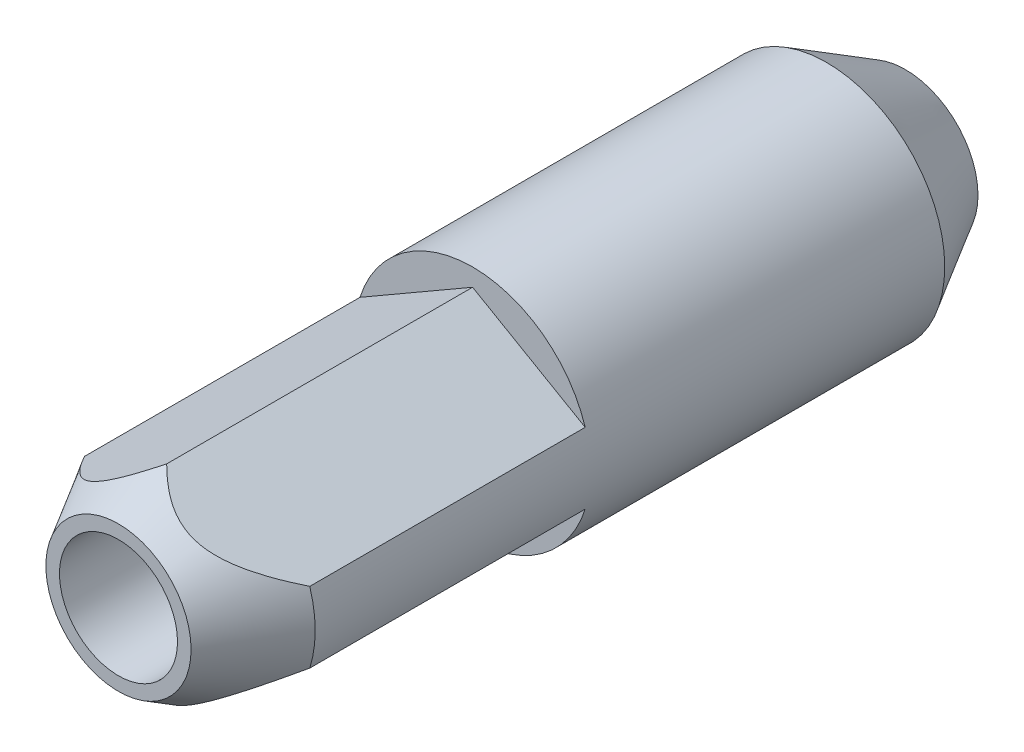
ISO-10303-21;
HEADER;
FILE_DESCRIPTION(('STEP AP214'),'2;1');
FILE_NAME('part.step','',(''),(''),'','','');
FILE_SCHEMA(('AUTOMOTIVE_DESIGN { 1 0 10303 214 1 1 1 1 }'));
ENDSEC;
DATA;
#1=APPLICATION_CONTEXT('core data for automotive mechanical design processes');
#2=APPLICATION_PROTOCOL_DEFINITION('international standard','automotive_design',2000,#1);
#3=PRODUCT_CONTEXT('',#1,'mechanical');
#4=PRODUCT('Part','Part','',(#3));
#5=PRODUCT_RELATED_PRODUCT_CATEGORY('part','',(#4));
#6=PRODUCT_DEFINITION_FORMATION('','',#4);
#7=PRODUCT_DEFINITION_CONTEXT('part definition',#1,'design');
#8=PRODUCT_DEFINITION('design','',#6,#7);
#9=PRODUCT_DEFINITION_SHAPE('','',#8);
#10=(LENGTH_UNIT() NAMED_UNIT(*) SI_UNIT(.MILLI.,.METRE.));
#11=(NAMED_UNIT(*) PLANE_ANGLE_UNIT() SI_UNIT($,.RADIAN.));
#12=(NAMED_UNIT(*) SI_UNIT($,.STERADIAN.) SOLID_ANGLE_UNIT());
#13=UNCERTAINTY_MEASURE_WITH_UNIT(LENGTH_MEASURE(1.E-05),#10,'distance_accuracy_value','');
#14=(GEOMETRIC_REPRESENTATION_CONTEXT(3) GLOBAL_UNCERTAINTY_ASSIGNED_CONTEXT((#13)) GLOBAL_UNIT_ASSIGNED_CONTEXT((#10,
#11,#12)) REPRESENTATION_CONTEXT('',''));
#15=CARTESIAN_POINT('',(0.,0.,0.));
#16=DIRECTION('',(0.,0.,1.));
#17=DIRECTION('',(1.,0.,0.));
#18=AXIS2_PLACEMENT_3D('',#15,#16,#17);
#19=CARTESIAN_POINT('',(0.,0.,18.));
#20=DIRECTION('',(0.,0.,-1.));
#21=DIRECTION('',(-1.,0.,0.));
#22=AXIS2_PLACEMENT_3D('',#19,#20,#21);
#23=CONICAL_SURFACE('',#22,3.,0.523598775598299);
#24=CARTESIAN_POINT('',(0.,0.,20.));
#25=DIRECTION('',(0.,0.,1.));
#26=DIRECTION('',(1.,0.,0.));
#27=AXIS2_PLACEMENT_3D('',#24,#25,#26);
#28=CIRCLE('',#27,1.84529946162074);
#29=CARTESIAN_POINT('',(1.84529946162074,0.,20.));
#30=VERTEX_POINT('',#29);
#31=EDGE_CURVE('E157',#30,#30,#28,.T.);
#32=ORIENTED_EDGE('',*,*,#31,.F.);
#33=EDGE_LOOP('',(#32));
#34=FACE_BOUND('',#33,.T.);
#35=CARTESIAN_POINT('',(-0.000199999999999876,2.55238663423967,18.7752890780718));
#36=CARTESIAN_POINT('',(0.0460344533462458,2.52569316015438,18.8214743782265));
#37=CARTESIAN_POINT('',(0.0931933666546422,2.49846594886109,18.8665157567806));
#38=CARTESIAN_POINT('',(0.189955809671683,2.44260012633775,18.9535711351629));
#39=CARTESIAN_POINT('',(0.239571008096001,2.41395477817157,18.9955677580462));
#40=CARTESIAN_POINT('',(0.34269103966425,2.3544184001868,19.0763265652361));
#41=CARTESIAN_POINT('',(0.396263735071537,2.32348819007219,19.1149751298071));
#42=CARTESIAN_POINT('',(0.506284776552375,2.25996751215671,19.186101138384));
#43=CARTESIAN_POINT('',(0.562726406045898,2.22738092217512,19.2185922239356));
#44=CARTESIAN_POINT('',(0.683762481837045,2.15750071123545,19.2779748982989));
#45=CARTESIAN_POINT('',(0.748638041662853,2.12004478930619,19.3041269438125));
#46=CARTESIAN_POINT('',(0.880771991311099,2.04375721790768,19.3437172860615));
#47=CARTESIAN_POINT('',(0.948006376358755,2.00493942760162,19.3572584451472));
#48=CARTESIAN_POINT('',(1.08417192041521,1.92632421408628,19.3699471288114));
#49=CARTESIAN_POINT('',(1.15311305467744,1.88652103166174,19.3689592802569));
#50=CARTESIAN_POINT('',(1.28973218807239,1.80764393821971,19.3524236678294));
#51=CARTESIAN_POINT('',(1.35740744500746,1.76857161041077,19.3368473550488));
#52=CARTESIAN_POINT('',(1.50861090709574,1.6812742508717,19.2872489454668));
#53=CARTESIAN_POINT('',(1.59113279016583,1.63363021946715,19.2492234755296));
#54=CARTESIAN_POINT('',(1.71058416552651,1.56466493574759,19.1815694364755));
#55=CARTESIAN_POINT('',(1.74986876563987,1.54198396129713,19.1570960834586));
#56=CARTESIAN_POINT('',(1.82697593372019,1.49746611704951,19.105250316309));
#57=CARTESIAN_POINT('',(1.86479886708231,1.47562903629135,19.0778786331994));
#58=CARTESIAN_POINT('',(1.94909791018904,1.42695896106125,19.0130933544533));
#59=CARTESIAN_POINT('',(1.99515689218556,1.40036679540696,18.9749623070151));
#60=CARTESIAN_POINT('',(2.08535834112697,1.34828896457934,18.8957734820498));
#61=CARTESIAN_POINT('',(2.12950000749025,1.32280376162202,18.8547145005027));
#62=CARTESIAN_POINT('',(2.25966628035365,1.24765222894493,18.7279277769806));
#63=CARTESIAN_POINT('',(2.34319057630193,1.19942945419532,18.6387853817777));
#64=CARTESIAN_POINT('',(2.50121771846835,1.10819244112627,18.459425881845));
#65=CARTESIAN_POINT('',(2.5759629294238,1.0650382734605,18.369486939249));
#66=CARTESIAN_POINT('',(2.68528856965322,1.00191908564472,18.2322142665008));
#67=CARTESIAN_POINT('',(2.72114587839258,0.981216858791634,18.1862256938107));
#68=CARTESIAN_POINT('',(2.79211447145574,0.940243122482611,18.0935055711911));
#69=CARTESIAN_POINT('',(2.82722592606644,0.919971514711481,18.0467741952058));
#70=CARTESIAN_POINT('',(2.86201760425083,0.899884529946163,17.99972953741));
#71=B_SPLINE_CURVE_WITH_KNOTS('',3,(#35,#36,#37,#38,#39,#40,#41,#42,#43,#44,#45,#46,#47,#48,#49,
#50,#51,#52,#53,#54,#55,#56,#57,#58,#59,#60,#61,#62,#63,#64,#65,#66,#67,#68,#69,#70),
.UNSPECIFIED.,.F.,.F.,(4,2,2,2,2,2,2,2,2,2,2,2,2,2,2,2,2,4),(0.,0.211847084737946,
0.424820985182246,0.643376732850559,0.861442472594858,1.09860494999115,1.33381558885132,
1.57121916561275,1.80908830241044,2.11503689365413,2.26959857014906,2.42412135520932,
2.62031527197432,2.81659033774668,3.21015736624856,3.58398424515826,3.76961845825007,
3.9552098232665),.UNSPECIFIED.);
#72=CARTESIAN_POINT('',(0.,2.55227116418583,18.7754890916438));
#73=VERTEX_POINT('',#72);
#74=CARTESIAN_POINT('',(2.86181760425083,0.9,18.));
#75=VERTEX_POINT('',#74);
#76=EDGE_CURVE('E99',#73,#75,#71,.T.);
#77=ORIENTED_EDGE('',*,*,#76,.F.);
#78=CARTESIAN_POINT('',(0.000199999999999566,2.55238663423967,18.7752890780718));
#79=CARTESIAN_POINT('',(-0.0460344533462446,2.52569316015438,18.8214743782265));
#80=CARTESIAN_POINT('',(-0.0931933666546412,2.49846594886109,18.8665157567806));
#81=CARTESIAN_POINT('',(-0.189955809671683,2.44260012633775,18.9535711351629));
#82=CARTESIAN_POINT('',(-0.239571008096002,2.41395477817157,18.9955677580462));
#83=CARTESIAN_POINT('',(-0.342691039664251,2.3544184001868,19.0763265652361));
#84=CARTESIAN_POINT('',(-0.396263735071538,2.32348819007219,19.1149751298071));
#85=CARTESIAN_POINT('',(-0.506284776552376,2.25996751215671,19.186101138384));
#86=CARTESIAN_POINT('',(-0.562726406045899,2.22738092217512,19.2185922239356));
#87=CARTESIAN_POINT('',(-0.683762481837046,2.15750071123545,19.2779748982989));
#88=CARTESIAN_POINT('',(-0.748638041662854,2.12004478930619,19.3041269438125));
#89=CARTESIAN_POINT('',(-0.8807719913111,2.04375721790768,19.3437172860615));
#90=CARTESIAN_POINT('',(-0.948006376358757,2.00493942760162,19.3572584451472));
#91=CARTESIAN_POINT('',(-1.08417192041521,1.92632421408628,19.3699471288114));
#92=CARTESIAN_POINT('',(-1.15311305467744,1.88652103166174,19.3689592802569));
#93=CARTESIAN_POINT('',(-1.28973218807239,1.80764393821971,19.3524236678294));
#94=CARTESIAN_POINT('',(-1.35740744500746,1.76857161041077,19.3368473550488));
#95=CARTESIAN_POINT('',(-1.50861090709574,1.6812742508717,19.2872489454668));
#96=CARTESIAN_POINT('',(-1.59113279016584,1.63363021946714,19.2492234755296));
#97=CARTESIAN_POINT('',(-1.71058416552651,1.56466493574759,19.1815694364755));
#98=CARTESIAN_POINT('',(-1.74986876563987,1.54198396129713,19.1570960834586));
#99=CARTESIAN_POINT('',(-1.82697593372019,1.49746611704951,19.105250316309));
#100=CARTESIAN_POINT('',(-1.86479886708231,1.47562903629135,19.0778786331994));
#101=CARTESIAN_POINT('',(-1.94909791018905,1.42695896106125,19.0130933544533));
#102=CARTESIAN_POINT('',(-1.99515689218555,1.40036679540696,18.9749623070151));
#103=CARTESIAN_POINT('',(-2.08535834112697,1.34828896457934,18.8957734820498));
#104=CARTESIAN_POINT('',(-2.12950000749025,1.32280376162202,18.8547145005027));
#105=CARTESIAN_POINT('',(-2.25966628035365,1.24765222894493,18.7279277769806));
#106=CARTESIAN_POINT('',(-2.34319057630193,1.19942945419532,18.6387853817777));
#107=CARTESIAN_POINT('',(-2.50121771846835,1.10819244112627,18.459425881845));
#108=CARTESIAN_POINT('',(-2.5759629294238,1.0650382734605,18.369486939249));
#109=CARTESIAN_POINT('',(-2.68528856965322,1.00191908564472,18.2322142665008));
#110=CARTESIAN_POINT('',(-2.72114587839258,0.981216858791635,18.1862256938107));
#111=CARTESIAN_POINT('',(-2.79211447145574,0.94024312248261,18.0935055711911));
#112=CARTESIAN_POINT('',(-2.82722592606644,0.91997151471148,18.0467741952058));
#113=CARTESIAN_POINT('',(-2.86201760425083,0.899884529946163,17.99972953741));
#114=B_SPLINE_CURVE_WITH_KNOTS('',3,(#78,#79,#80,#81,#82,#83,#84,#85,#86,#87,#88,#89,#90,#91,
#92,#93,#94,#95,#96,#97,#98,#99,#100,#101,#102,#103,#104,#105,#106,#107,#108,#109,#110,#111,
#112,#113),.UNSPECIFIED.,.F.,.F.,(4,2,2,2,2,2,2,2,2,2,2,2,2,2,2,2,2,4),(0.,0.211847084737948,
0.424820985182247,0.64337673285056,0.861442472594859,1.09860494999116,1.33381558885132,
1.57121916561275,1.80908830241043,2.11503689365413,2.26959857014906,2.42412135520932,
2.62031527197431,2.81659033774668,3.21015736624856,3.58398424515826,3.76961845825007,
3.9552098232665),.UNSPECIFIED.);
#115=CARTESIAN_POINT('',(-2.86181760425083,0.9,18.));
#116=VERTEX_POINT('',#115);
#117=EDGE_CURVE('E74',#73,#116,#114,.T.);
#118=ORIENTED_EDGE('',*,*,#117,.T.);
#119=CARTESIAN_POINT('',(0.,0.,18.));
#120=DIRECTION('',(0.,0.,1.));
#121=DIRECTION('',(1.,0.,0.));
#122=AXIS2_PLACEMENT_3D('',#119,#120,#121);
#123=CIRCLE('',#122,3.);
#124=CARTESIAN_POINT('',(-2.86181760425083,-0.9,18.));
#125=VERTEX_POINT('',#124);
#126=EDGE_CURVE('E153',#116,#125,#123,.T.);
#127=ORIENTED_EDGE('',*,*,#126,.T.);
#128=CARTESIAN_POINT('',(0.0002,-2.55238663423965,18.7752890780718));
#129=CARTESIAN_POINT('',(-0.0460344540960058,-2.52569315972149,18.8214743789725));
#130=CARTESIAN_POINT('',(-0.0931933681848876,-2.49846594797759,18.8665157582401));
#131=CARTESIAN_POINT('',(-0.189955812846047,-2.44260012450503,18.9535711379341));
#132=CARTESIAN_POINT('',(-0.239571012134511,-2.41395477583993,18.9955677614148));
#133=CARTESIAN_POINT('',(-0.342691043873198,-2.35441839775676,19.0763265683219));
#134=CARTESIAN_POINT('',(-0.396263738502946,-2.32348818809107,19.1149751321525));
#135=CARTESIAN_POINT('',(-0.506284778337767,-2.2599675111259,19.1861011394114));
#136=CARTESIAN_POINT('',(-0.562726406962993,-2.22738092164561,19.2185922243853));
#137=CARTESIAN_POINT('',(-0.683762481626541,-2.15750071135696,19.277974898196));
#138=CARTESIAN_POINT('',(-0.74863804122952,-2.12004478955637,19.3041269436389));
#139=CARTESIAN_POINT('',(-0.880771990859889,-2.04375721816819,19.3437172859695));
#140=CARTESIAN_POINT('',(-0.948006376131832,-2.00493942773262,19.3572584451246));
#141=CARTESIAN_POINT('',(-1.08417191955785,-1.92632421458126,19.3699471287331));
#142=CARTESIAN_POINT('',(-1.15311305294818,-1.88652103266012,19.3689592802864));
#143=CARTESIAN_POINT('',(-1.289732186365,-1.80764393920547,19.3524236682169));
#144=CARTESIAN_POINT('',(-1.35740744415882,-1.76857161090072,19.3368473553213));
#145=CARTESIAN_POINT('',(-1.50861091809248,-1.68127424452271,19.2872489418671));
#146=CARTESIAN_POINT('',(-1.59113281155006,-1.63363020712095,19.2492234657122));
#147=CARTESIAN_POINT('',(-1.71058419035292,-1.56466492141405,19.1815694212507));
#148=CARTESIAN_POINT('',(-1.7498687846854,-1.54198395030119,19.1570960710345));
#149=CARTESIAN_POINT('',(-1.82697594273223,-1.4974661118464,19.1052503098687));
#150=CARTESIAN_POINT('',(-1.864798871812,-1.47562903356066,19.0778786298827));
#151=CARTESIAN_POINT('',(-1.94909496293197,-1.42696066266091,19.0130956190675));
#152=CARTESIAN_POINT('',(-1.99515113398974,-1.40037011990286,18.9749670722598));
#153=CARTESIAN_POINT('',(-2.0853471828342,-1.34829540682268,18.8957835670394));
#154=CARTESIAN_POINT('',(-2.12948626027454,-1.32281169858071,18.8547274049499));
#155=CARTESIAN_POINT('',(-2.2596449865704,-1.24766452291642,18.727949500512));
#156=CARTESIAN_POINT('',(-2.34316459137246,-1.19944445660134,18.6388134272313));
#157=CARTESIAN_POINT('',(-2.50118334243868,-1.10821228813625,18.459466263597));
#158=CARTESIAN_POINT('',(-2.57592481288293,-1.06506028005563,18.3695332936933));
#159=CARTESIAN_POINT('',(-2.68524504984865,-1.0019442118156,18.232269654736));
#160=CARTESIAN_POINT('',(-2.72110061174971,-0.981242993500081,18.1862840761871));
#161=CARTESIAN_POINT('',(-2.79206575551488,-0.940271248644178,18.0935699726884));
#162=CARTESIAN_POINT('',(-2.82717550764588,-0.920000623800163,18.0468416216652));
#163=CARTESIAN_POINT('',(-2.86196550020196,-0.899914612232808,17.9998));
#164=B_SPLINE_CURVE_WITH_KNOTS('',3,(#128,#129,#130,#131,#132,#133,#134,#135,#136,#137,#138,
#139,#140,#141,#142,#143,#144,#145,#146,#147,#148,#149,#150,#151,#152,#153,#154,#155,#156,#157,
#158,#159,#160,#161,#162,#163),.UNSPECIFIED.,.F.,.F.,(4,2,2,2,2,2,2,2,2,2,2,2,2,2,2,2,2,4),(0.,
0.2118470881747,0.424820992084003,0.643376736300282,0.861442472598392,1.09860494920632,
1.3338155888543,1.57121916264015,1.80908830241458,2.11503693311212,2.26959858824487,
2.42412135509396,2.62030301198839,2.81656579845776,3.21010807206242,3.58391305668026,
3.76953654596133,3.95511719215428),.UNSPECIFIED.);
#165=CARTESIAN_POINT('',(0.,-2.55227116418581,18.7754890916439));
#166=VERTEX_POINT('',#165);
#167=EDGE_CURVE('E127',#166,#125,#164,.T.);
#168=ORIENTED_EDGE('',*,*,#167,.F.);
#169=CARTESIAN_POINT('',(-0.000200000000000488,-2.55238663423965,18.7752890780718));
#170=CARTESIAN_POINT('',(0.0460344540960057,-2.52569315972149,18.8214743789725));
#171=CARTESIAN_POINT('',(0.0931933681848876,-2.49846594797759,18.8665157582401));
#172=CARTESIAN_POINT('',(0.189955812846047,-2.44260012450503,18.9535711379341));
#173=CARTESIAN_POINT('',(0.23957101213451,-2.41395477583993,18.9955677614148));
#174=CARTESIAN_POINT('',(0.342691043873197,-2.35441839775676,19.0763265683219));
#175=CARTESIAN_POINT('',(0.396263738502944,-2.32348818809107,19.1149751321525));
#176=CARTESIAN_POINT('',(0.506284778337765,-2.2599675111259,19.1861011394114));
#177=CARTESIAN_POINT('',(0.562726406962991,-2.22738092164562,19.2185922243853));
#178=CARTESIAN_POINT('',(0.683762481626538,-2.15750071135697,19.277974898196));
#179=CARTESIAN_POINT('',(0.748638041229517,-2.12004478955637,19.3041269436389));
#180=CARTESIAN_POINT('',(0.880771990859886,-2.04375721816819,19.3437172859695));
#181=CARTESIAN_POINT('',(0.948006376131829,-2.00493942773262,19.3572584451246));
#182=CARTESIAN_POINT('',(1.08417191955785,-1.92632421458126,19.3699471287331));
#183=CARTESIAN_POINT('',(1.15311305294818,-1.88652103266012,19.3689592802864));
#184=CARTESIAN_POINT('',(1.289732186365,-1.80764393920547,19.3524236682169));
#185=CARTESIAN_POINT('',(1.35740744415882,-1.76857161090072,19.3368473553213));
#186=CARTESIAN_POINT('',(1.50861091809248,-1.68127424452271,19.2872489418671));
#187=CARTESIAN_POINT('',(1.59113281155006,-1.63363020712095,19.2492234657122));
#188=CARTESIAN_POINT('',(1.71058419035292,-1.56466492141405,19.1815694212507));
#189=CARTESIAN_POINT('',(1.7498687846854,-1.54198395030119,19.1570960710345));
#190=CARTESIAN_POINT('',(1.82697594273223,-1.4974661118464,19.1052503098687));
#191=CARTESIAN_POINT('',(1.864798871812,-1.47562903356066,19.0778786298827));
#192=CARTESIAN_POINT('',(1.94909496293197,-1.42696066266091,19.0130956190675));
#193=CARTESIAN_POINT('',(1.99515113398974,-1.40037011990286,18.9749670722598));
#194=CARTESIAN_POINT('',(2.0853471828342,-1.34829540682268,18.8957835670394));
#195=CARTESIAN_POINT('',(2.12948626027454,-1.32281169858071,18.8547274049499));
#196=CARTESIAN_POINT('',(2.2596449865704,-1.24766452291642,18.727949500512));
#197=CARTESIAN_POINT('',(2.34316459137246,-1.19944445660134,18.6388134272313));
#198=CARTESIAN_POINT('',(2.50118334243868,-1.10821228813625,18.459466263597));
#199=CARTESIAN_POINT('',(2.57592481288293,-1.06506028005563,18.3695332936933));
#200=CARTESIAN_POINT('',(2.68524504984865,-1.0019442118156,18.232269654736));
#201=CARTESIAN_POINT('',(2.72110061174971,-0.981242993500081,18.1862840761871));
#202=CARTESIAN_POINT('',(2.79206575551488,-0.940271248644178,18.0935699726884));
#203=CARTESIAN_POINT('',(2.82717550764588,-0.920000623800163,18.0468416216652));
#204=CARTESIAN_POINT('',(2.86196550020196,-0.899914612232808,17.9998));
#205=B_SPLINE_CURVE_WITH_KNOTS('',3,(#169,#170,#171,#172,#173,#174,#175,#176,#177,#178,#179,
#180,#181,#182,#183,#184,#185,#186,#187,#188,#189,#190,#191,#192,#193,#194,#195,#196,#197,#198,
#199,#200,#201,#202,#203,#204),.UNSPECIFIED.,.F.,.F.,(4,2,2,2,2,2,2,2,2,2,2,2,2,2,2,2,2,4),(0.,
0.2118470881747,0.424820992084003,0.643376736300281,0.861442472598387,1.09860494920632,
1.33381558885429,1.57121916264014,1.80908830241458,2.11503693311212,2.26959858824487,
2.42412135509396,2.62030301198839,2.81656579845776,3.21010807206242,3.58391305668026,
3.76953654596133,3.95511719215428),.UNSPECIFIED.);
#206=CARTESIAN_POINT('',(2.86181760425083,-0.9,18.));
#207=VERTEX_POINT('',#206);
#208=EDGE_CURVE('E136',#166,#207,#205,.T.);
#209=ORIENTED_EDGE('',*,*,#208,.T.);
#210=EDGE_CURVE('E154',#207,#75,#123,.T.);
#211=ORIENTED_EDGE('',*,*,#210,.T.);
#212=EDGE_LOOP('',(#77,#118,#127,#168,#209,#211));
#213=FACE_BOUND('',#212,.T.);
#214=ADVANCED_FACE('F14',(#34,#213),#23,.T.);
#215=CARTESIAN_POINT('',(0.,0.,30.));
#216=DIRECTION('',(0.,0.,1.));
#217=DIRECTION('',(1.,0.,0.));
#218=AXIS2_PLACEMENT_3D('',#215,#216,#217);
#219=CYLINDRICAL_SURFACE('',#218,3.);
#220=CARTESIAN_POINT('',(0.,0.,2.));
#221=DIRECTION('',(0.,0.,1.));
#222=DIRECTION('',(1.,0.,0.));
#223=AXIS2_PLACEMENT_3D('',#220,#221,#222);
#224=CIRCLE('',#223,3.);
#225=CARTESIAN_POINT('',(3.,0.,2.));
#226=VERTEX_POINT('',#225);
#227=EDGE_CURVE('E150',#226,#226,#224,.T.);
#228=ORIENTED_EDGE('',*,*,#227,.T.);
#229=EDGE_LOOP('',(#228));
#230=FACE_BOUND('',#229,.T.);
#231=DIRECTION('',(0.,0.,1.));
#232=VECTOR('',#231,1.);
#233=CARTESIAN_POINT('',(2.86181760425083,0.9,11.));
#234=LINE('',#233,#232);
#235=CARTESIAN_POINT('',(2.86181760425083,0.9,11.));
#236=VERTEX_POINT('',#235);
#237=EDGE_CURVE('E81',#236,#75,#234,.T.);
#238=ORIENTED_EDGE('',*,*,#237,.T.);
#239=ORIENTED_EDGE('',*,*,#210,.F.);
#240=DIRECTION('',(0.,0.,1.));
#241=VECTOR('',#240,1.);
#242=CARTESIAN_POINT('',(2.86181760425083,-0.9,11.));
#243=LINE('',#242,#241);
#244=CARTESIAN_POINT('',(2.86181760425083,-0.9,11.));
#245=VERTEX_POINT('',#244);
#246=EDGE_CURVE('E186',#245,#207,#243,.T.);
#247=ORIENTED_EDGE('',*,*,#246,.F.);
#248=CARTESIAN_POINT('',(0.,0.,11.));
#249=DIRECTION('',(0.,0.,1.));
#250=DIRECTION('',(1.,0.,0.));
#251=AXIS2_PLACEMENT_3D('',#248,#249,#250);
#252=CIRCLE('',#251,3.);
#253=CARTESIAN_POINT('',(-2.86181760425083,-0.9,11.));
#254=VERTEX_POINT('',#253);
#255=EDGE_CURVE('E176',#254,#245,#252,.T.);
#256=ORIENTED_EDGE('',*,*,#255,.F.);
#257=DIRECTION('',(0.,0.,1.));
#258=VECTOR('',#257,1.);
#259=CARTESIAN_POINT('',(-2.86181760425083,-0.9,11.));
#260=LINE('',#259,#258);
#261=EDGE_CURVE('E183',#254,#125,#260,.T.);
#262=ORIENTED_EDGE('',*,*,#261,.T.);
#263=ORIENTED_EDGE('',*,*,#126,.F.);
#264=DIRECTION('',(0.,0.,1.));
#265=VECTOR('',#264,1.);
#266=CARTESIAN_POINT('',(-2.86181760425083,0.9,11.));
#267=LINE('',#266,#265);
#268=CARTESIAN_POINT('',(-2.86181760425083,0.9,11.));
#269=VERTEX_POINT('',#268);
#270=EDGE_CURVE('E77',#269,#116,#267,.T.);
#271=ORIENTED_EDGE('',*,*,#270,.F.);
#272=CARTESIAN_POINT('',(0.,0.,11.));
#273=DIRECTION('',(0.,0.,1.));
#274=DIRECTION('',(1.,0.,0.));
#275=AXIS2_PLACEMENT_3D('',#272,#273,#274);
#276=CIRCLE('',#275,3.);
#277=EDGE_CURVE('E85',#236,#269,#276,.T.);
#278=ORIENTED_EDGE('',*,*,#277,.F.);
#279=EDGE_LOOP('',(#238,#239,#247,#256,#262,#263,#271,#278));
#280=FACE_BOUND('',#279,.T.);
#281=ADVANCED_FACE('F172',(#230,#280),#219,.T.);
#282=CARTESIAN_POINT('',(0.,0.,12.));
#283=DIRECTION('',(0.,0.,1.));
#284=DIRECTION('',(1.,0.,0.));
#285=AXIS2_PLACEMENT_3D('',#282,#283,#284);
#286=PLANE('',#285);
#287=CARTESIAN_POINT('',(0.,0.,12.));
#288=DIRECTION('',(0.,0.,1.));
#289=DIRECTION('',(1.,0.,0.));
#290=AXIS2_PLACEMENT_3D('',#287,#288,#289);
#291=CIRCLE('',#290,1.5);
#292=CARTESIAN_POINT('',(1.5,0.,12.));
#293=VERTEX_POINT('',#292);
#294=EDGE_CURVE('E9',#293,#293,#291,.T.);
#295=ORIENTED_EDGE('',*,*,#294,.T.);
#296=EDGE_LOOP('',(#295));
#297=FACE_BOUND('',#296,.T.);
#298=ADVANCED_FACE('F16',(#297),#286,.T.);
#299=CARTESIAN_POINT('',(0.,0.,30.));
#300=DIRECTION('',(0.,0.,1.));
#301=DIRECTION('',(1.,0.,0.));
#302=AXIS2_PLACEMENT_3D('',#299,#300,#301);
#303=CYLINDRICAL_SURFACE('',#302,1.5);
#304=ORIENTED_EDGE('',*,*,#294,.F.);
#305=EDGE_LOOP('',(#304));
#306=FACE_BOUND('',#305,.T.);
#307=CARTESIAN_POINT('',(0.,0.,20.));
#308=DIRECTION('',(0.,0.,1.));
#309=DIRECTION('',(1.,0.,0.));
#310=AXIS2_PLACEMENT_3D('',#307,#308,#309);
#311=CIRCLE('',#310,1.5);
#312=CARTESIAN_POINT('',(1.5,0.,20.));
#313=VERTEX_POINT('',#312);
#314=EDGE_CURVE('E22',#313,#313,#311,.T.);
#315=ORIENTED_EDGE('',*,*,#314,.T.);
#316=EDGE_LOOP('',(#315));
#317=FACE_BOUND('',#316,.T.);
#318=ADVANCED_FACE('F162',(#306,#317),#303,.F.);
#319=CARTESIAN_POINT('',(1.84529946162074,0.,20.));
#320=DIRECTION('',(0.,0.,-1.));
#321=DIRECTION('',(-1.,0.,0.));
#322=AXIS2_PLACEMENT_3D('',#319,#320,#321);
#323=PLANE('',#322);
#324=ORIENTED_EDGE('',*,*,#314,.F.);
#325=EDGE_LOOP('',(#324));
#326=FACE_BOUND('',#325,.T.);
#327=ORIENTED_EDGE('',*,*,#31,.T.);
#328=EDGE_LOOP('',(#327));
#329=FACE_BOUND('',#328,.T.);
#330=ADVANCED_FACE('F164',(#326,#329),#323,.F.);
#331=CARTESIAN_POINT('',(0.,0.,0.));
#332=DIRECTION('',(0.,0.,1.));
#333=DIRECTION('',(1.,0.,0.));
#334=AXIS2_PLACEMENT_3D('',#331,#332,#333);
#335=CONICAL_SURFACE('',#334,1.84529946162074,0.523598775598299);
#336=ORIENTED_EDGE('',*,*,#227,.F.);
#337=EDGE_LOOP('',(#336));
#338=FACE_BOUND('',#337,.T.);
#339=CARTESIAN_POINT('',(0.,0.,0.));
#340=DIRECTION('',(0.,0.,1.));
#341=DIRECTION('',(1.,0.,0.));
#342=AXIS2_PLACEMENT_3D('',#339,#340,#341);
#343=CIRCLE('',#342,1.84529946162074);
#344=CARTESIAN_POINT('',(1.84529946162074,0.,0.));
#345=VERTEX_POINT('',#344);
#346=EDGE_CURVE('E147',#345,#345,#343,.T.);
#347=ORIENTED_EDGE('',*,*,#346,.T.);
#348=EDGE_LOOP('',(#347));
#349=FACE_BOUND('',#348,.T.);
#350=ADVANCED_FACE('F167',(#338,#349),#335,.T.);
#351=CARTESIAN_POINT('',(1.,0.,0.));
#352=DIRECTION('',(0.,0.,1.));
#353=DIRECTION('',(1.,0.,0.));
#354=AXIS2_PLACEMENT_3D('',#351,#352,#353);
#355=PLANE('',#354);
#356=ORIENTED_EDGE('',*,*,#346,.F.);
#357=EDGE_LOOP('',(#356));
#358=FACE_BOUND('',#357,.T.);
#359=CARTESIAN_POINT('',(0.,0.,0.));
#360=DIRECTION('',(0.,0.,1.));
#361=DIRECTION('',(1.,0.,0.));
#362=AXIS2_PLACEMENT_3D('',#359,#360,#361);
#363=CIRCLE('',#362,1.);
#364=CARTESIAN_POINT('',(1.,0.,0.));
#365=VERTEX_POINT('',#364);
#366=EDGE_CURVE('E144',#365,#365,#363,.T.);
#367=ORIENTED_EDGE('',*,*,#366,.T.);
#368=EDGE_LOOP('',(#367));
#369=FACE_BOUND('',#368,.T.);
#370=ADVANCED_FACE('F247',(#358,#369),#355,.F.);
#371=CARTESIAN_POINT('',(0.,0.,30.));
#372=DIRECTION('',(0.,0.,1.));
#373=DIRECTION('',(1.,0.,0.));
#374=AXIS2_PLACEMENT_3D('',#371,#372,#373);
#375=CYLINDRICAL_SURFACE('',#374,1.);
#376=ORIENTED_EDGE('',*,*,#366,.F.);
#377=EDGE_LOOP('',(#376));
#378=FACE_BOUND('',#377,.T.);
#379=CARTESIAN_POINT('',(0.,0.,4.));
#380=DIRECTION('',(0.,0.,1.));
#381=DIRECTION('',(1.,0.,0.));
#382=AXIS2_PLACEMENT_3D('',#379,#380,#381);
#383=CIRCLE('',#382,1.);
#384=CARTESIAN_POINT('',(1.,0.,4.));
#385=VERTEX_POINT('',#384);
#386=EDGE_CURVE('E135',#385,#385,#383,.T.);
#387=ORIENTED_EDGE('',*,*,#386,.T.);
#388=EDGE_LOOP('',(#387));
#389=FACE_BOUND('',#388,.T.);
#390=ADVANCED_FACE('F237',(#378,#389),#375,.F.);
#391=CARTESIAN_POINT('',(0.,0.,4.));
#392=DIRECTION('',(0.,0.,1.));
#393=DIRECTION('',(1.,0.,0.));
#394=AXIS2_PLACEMENT_3D('',#391,#392,#393);
#395=PLANE('',#394);
#396=ORIENTED_EDGE('',*,*,#386,.F.);
#397=EDGE_LOOP('',(#396));
#398=FACE_BOUND('',#397,.T.);
#399=ADVANCED_FACE('F122',(#398),#395,.F.);
#400=CARTESIAN_POINT('',(-2.86181760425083,-0.9,11.));
#401=DIRECTION('',(-0.5,-0.866025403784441,0.));
#402=DIRECTION('',(0.866025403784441,-0.5,0.));
#403=AXIS2_PLACEMENT_3D('',#400,#401,#402);
#404=PLANE('',#403);
#405=ORIENTED_EDGE('',*,*,#167,.T.);
#406=ORIENTED_EDGE('',*,*,#261,.F.);
#407=DIRECTION('',(0.866025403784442,-0.5,0.));
#408=VECTOR('',#407,1.);
#409=CARTESIAN_POINT('',(-2.86181760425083,-0.9,11.));
#410=LINE('',#409,#408);
#411=CARTESIAN_POINT('',(0.,-2.55227116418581,11.));
#412=VERTEX_POINT('',#411);
#413=EDGE_CURVE('E37',#254,#412,#410,.T.);
#414=ORIENTED_EDGE('',*,*,#413,.T.);
#415=DIRECTION('',(0.,0.,1.));
#416=VECTOR('',#415,1.);
#417=CARTESIAN_POINT('',(0.,-2.55227116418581,11.));
#418=LINE('',#417,#416);
#419=EDGE_CURVE('E187',#412,#166,#418,.T.);
#420=ORIENTED_EDGE('',*,*,#419,.T.);
#421=EDGE_LOOP('',(#405,#406,#414,#420));
#422=FACE_BOUND('',#421,.T.);
#423=ADVANCED_FACE('F118',(#422),#404,.T.);
#424=CARTESIAN_POINT('',(2.86181760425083,-0.9,11.));
#425=DIRECTION('',(-0.5,0.866025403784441,0.));
#426=DIRECTION('',(-0.866025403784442,-0.5,0.));
#427=AXIS2_PLACEMENT_3D('',#424,#425,#426);
#428=PLANE('',#427);
#429=ORIENTED_EDGE('',*,*,#419,.F.);
#430=DIRECTION('',(-0.866025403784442,-0.5,0.));
#431=VECTOR('',#430,1.);
#432=CARTESIAN_POINT('',(2.86181760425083,-0.9,11.));
#433=LINE('',#432,#431);
#434=EDGE_CURVE('E177',#245,#412,#433,.T.);
#435=ORIENTED_EDGE('',*,*,#434,.F.);
#436=ORIENTED_EDGE('',*,*,#246,.T.);
#437=ORIENTED_EDGE('',*,*,#208,.F.);
#438=EDGE_LOOP('',(#429,#435,#436,#437));
#439=FACE_BOUND('',#438,.T.);
#440=ADVANCED_FACE('F117',(#439),#428,.F.);
#441=CARTESIAN_POINT('',(0.,0.,11.));
#442=DIRECTION('',(0.,0.,1.));
#443=DIRECTION('',(1.,0.,0.));
#444=AXIS2_PLACEMENT_3D('',#441,#442,#443);
#445=PLANE('',#444);
#446=ORIENTED_EDGE('',*,*,#413,.F.);
#447=ORIENTED_EDGE('',*,*,#255,.T.);
#448=ORIENTED_EDGE('',*,*,#434,.T.);
#449=EDGE_LOOP('',(#446,#447,#448));
#450=FACE_BOUND('',#449,.T.);
#451=ADVANCED_FACE('F114',(#450),#445,.T.);
#452=CARTESIAN_POINT('',(2.86181760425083,0.9,11.));
#453=DIRECTION('',(0.5,0.866025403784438,0.));
#454=DIRECTION('',(-0.866025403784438,0.5,0.));
#455=AXIS2_PLACEMENT_3D('',#452,#453,#454);
#456=PLANE('',#455);
#457=ORIENTED_EDGE('',*,*,#76,.T.);
#458=ORIENTED_EDGE('',*,*,#237,.F.);
#459=DIRECTION('',(-0.866025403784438,0.5,0.));
#460=VECTOR('',#459,1.);
#461=CARTESIAN_POINT('',(2.86181760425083,0.9,11.));
#462=LINE('',#461,#460);
#463=CARTESIAN_POINT('',(0.,2.55227116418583,11.));
#464=VERTEX_POINT('',#463);
#465=EDGE_CURVE('E29',#236,#464,#462,.T.);
#466=ORIENTED_EDGE('',*,*,#465,.T.);
#467=DIRECTION('',(0.,0.,1.));
#468=VECTOR('',#467,1.);
#469=CARTESIAN_POINT('',(0.,2.55227116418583,11.));
#470=LINE('',#469,#468);
#471=EDGE_CURVE('E70',#464,#73,#470,.T.);
#472=ORIENTED_EDGE('',*,*,#471,.T.);
#473=EDGE_LOOP('',(#457,#458,#466,#472));
#474=FACE_BOUND('',#473,.T.);
#475=ADVANCED_FACE('F79',(#474),#456,.T.);
#476=CARTESIAN_POINT('',(-2.86181760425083,0.9,11.));
#477=DIRECTION('',(0.5,-0.866025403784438,0.));
#478=DIRECTION('',(0.866025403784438,0.5,0.));
#479=AXIS2_PLACEMENT_3D('',#476,#477,#478);
#480=PLANE('',#479);
#481=ORIENTED_EDGE('',*,*,#471,.F.);
#482=DIRECTION('',(0.866025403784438,0.5,0.));
#483=VECTOR('',#482,1.);
#484=CARTESIAN_POINT('',(-2.86181760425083,0.9,11.));
#485=LINE('',#484,#483);
#486=EDGE_CURVE('E72',#269,#464,#485,.T.);
#487=ORIENTED_EDGE('',*,*,#486,.F.);
#488=ORIENTED_EDGE('',*,*,#270,.T.);
#489=ORIENTED_EDGE('',*,*,#117,.F.);
#490=EDGE_LOOP('',(#481,#487,#488,#489));
#491=FACE_BOUND('',#490,.T.);
#492=ADVANCED_FACE('F71',(#491),#480,.F.);
#493=CARTESIAN_POINT('',(0.,0.,11.));
#494=DIRECTION('',(0.,0.,1.));
#495=DIRECTION('',(1.,0.,0.));
#496=AXIS2_PLACEMENT_3D('',#493,#494,#495);
#497=PLANE('',#496);
#498=ORIENTED_EDGE('',*,*,#465,.F.);
#499=ORIENTED_EDGE('',*,*,#277,.T.);
#500=ORIENTED_EDGE('',*,*,#486,.T.);
#501=EDGE_LOOP('',(#498,#499,#500));
#502=FACE_BOUND('',#501,.T.);
#503=ADVANCED_FACE('F84',(#502),#497,.T.);
#504=CLOSED_SHELL('',(#214,#281,#298,#318,#330,#350,#370,#390,#399,#423,#440,#451,#475,#492,#503));
#505=MANIFOLD_SOLID_BREP('B1',#504);
#506=ADVANCED_BREP_SHAPE_REPRESENTATION('',(#18,#505),#14);
#507=SHAPE_DEFINITION_REPRESENTATION(#9,#506);
ENDSEC;
END-ISO-10303-21;
